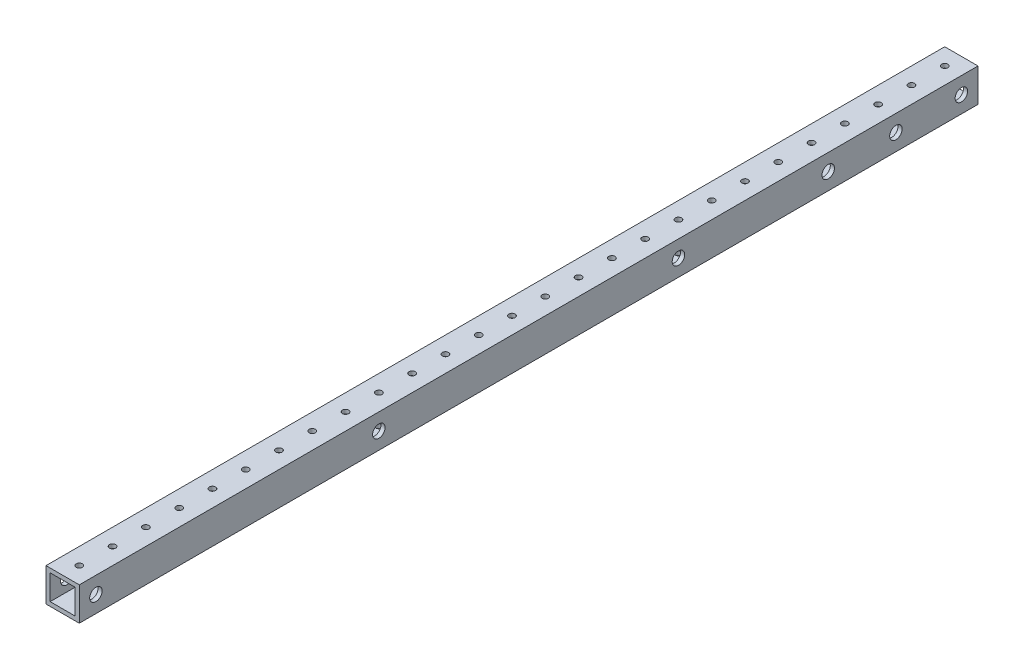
from build123d import *

# Parameters (mm, degrees)
SKETCH1_W           = 25.4
SKETCH1_H           = 25.4
SKETCH1_W_2         = 19.05
SKETCH1_H_2         = 19.05
BOSS_EXTRUDE1_DEPTH = 342.9
SKETCH2_R           = 4.7625
CUT_EXTRUDE1_DEPTH  = 345.073916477
SKETCH3_R           = 2.38125
CUT_EXTRUDE2_DEPTH  = 345.073916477
LPATTERN1_COUNT     = 30
LPATTERN1_PITCH     = 25.4
CUT_EXTRUDE5_REACH  = 346.074
SKETCH6_R           = 4.7625
CUT_EXTRUDE6_REACH  = 346.074
SKETCH7_R           = 2.4892


with BuildPart() as part:
    # Sketch1 → Boss-Extrude1 (new, symmetric)
    with BuildSketch(Plane.XY):
        Rectangle(SKETCH1_W, SKETCH1_H)
        Rectangle(SKETCH1_W_2, SKETCH1_H_2, mode=Mode.SUBTRACT)
    extrude(amount=BOSS_EXTRUDE1_DEPTH, both=True)

    # Sketch2 → Cut-Extrude1 (cut, through all)
    with BuildSketch(Plane(origin=(12.7, 0, 0), x_dir=(0, 0, -1), z_dir=(1, 0, 0))):
        with Locations(Location((-330.2, 0, 0), (0, 0, 90))):
            Circle(SKETCH2_R)
        with Locations(Location((330.2, 0, 0), (0, 0, 90))):
            Circle(SKETCH2_R)
        with Locations(Location((-114.3, 0, 0), (0, 0, 90))):
            Circle(SKETCH2_R)
        with Locations(Location((114.3, 0, 0), (0, 0, 90))):
            Circle(SKETCH2_R)
    extrude(amount=-CUT_EXTRUDE1_DEPTH, mode=Mode.SUBTRACT)

    # Sketch3 → Cut-Extrude2 (cut, through all)
    with BuildSketch(Plane.XZ.offset(12.7)):
        with Locations(Location((0, 330.2, 0), (0, 0, 270))):
            Circle(SKETCH3_R)
    cut_extrude2 = extrude(amount=-CUT_EXTRUDE2_DEPTH, mode=Mode.SUBTRACT)

    # LPattern1: Cut-Extrude2 ×30
    with Locations(*[(0, 0, -i * LPATTERN1_PITCH) for i in range(1, LPATTERN1_COUNT)]):
        add(cut_extrude2, mode=Mode.SUBTRACT)

    # Sketch6 → Cut-Extrude5 (cut, up to next)
    with BuildSketch(Plane(origin=(12.7, 0, 0), x_dir=(0, 0, -1), z_dir=(1, 0, 0)), mode=Mode.PRIVATE) as cut_extrude5_sk1:
        with Locations(Location((228.6, 0, 0), (0, 0, 90))):
            Circle(SKETCH6_R)
    cut_extrude5_tool1 = extrude(cut_extrude5_sk1.sketch, amount=-CUT_EXTRUDE5_REACH, mode=Mode.PRIVATE) & part.part
    # Sketch6 → Cut-Extrude5 (cut, up to next)
    with BuildSketch(Plane(origin=(12.7, 0, 0), x_dir=(0, 0, -1), z_dir=(1, 0, 0)), mode=Mode.PRIVATE) as cut_extrude5_sk2:
        with Locations(Location((280.2636, 0, 0), (0, 0, 90))):
            Circle(SKETCH6_R)
    cut_extrude5_tool2 = extrude(cut_extrude5_sk2.sketch, amount=-CUT_EXTRUDE5_REACH, mode=Mode.PRIVATE) & part.part
    add(cut_extrude5_tool1.solids().sort_by_distance((12.7, 0, -228.6))[0], mode=Mode.SUBTRACT)
    add(cut_extrude5_tool2.solids().sort_by_distance((12.7, 0, -280.2636))[0], mode=Mode.SUBTRACT)

    # Sketch7 → Cut-Extrude6 (cut, up to next)
    with BuildSketch(Plane.ZY.offset(12.7), mode=Mode.PRIVATE) as cut_extrude6_sk1:
        with Locations(Location((-280.2636, 0, 0), (0, 0, 270))):
            Circle(SKETCH7_R)
    cut_extrude6_tool1 = extrude(cut_extrude6_sk1.sketch, amount=-CUT_EXTRUDE6_REACH, mode=Mode.PRIVATE) & part.part
    # Sketch7 → Cut-Extrude6 (cut, up to next)
    with BuildSketch(Plane.ZY.offset(12.7), mode=Mode.PRIVATE) as cut_extrude6_sk2:
        with Locations(Location((-228.6, 0, 0), (0, 0, 270))):
            Circle(SKETCH7_R)
    cut_extrude6_tool2 = extrude(cut_extrude6_sk2.sketch, amount=-CUT_EXTRUDE6_REACH, mode=Mode.PRIVATE) & part.part
    add(cut_extrude6_tool1.solids().sort_by_distance((-12.7, 0, -280.2636))[0], mode=Mode.SUBTRACT)
    add(cut_extrude6_tool2.solids().sort_by_distance((-12.7, 0, -228.6))[0], mode=Mode.SUBTRACT)


solid = part.part
